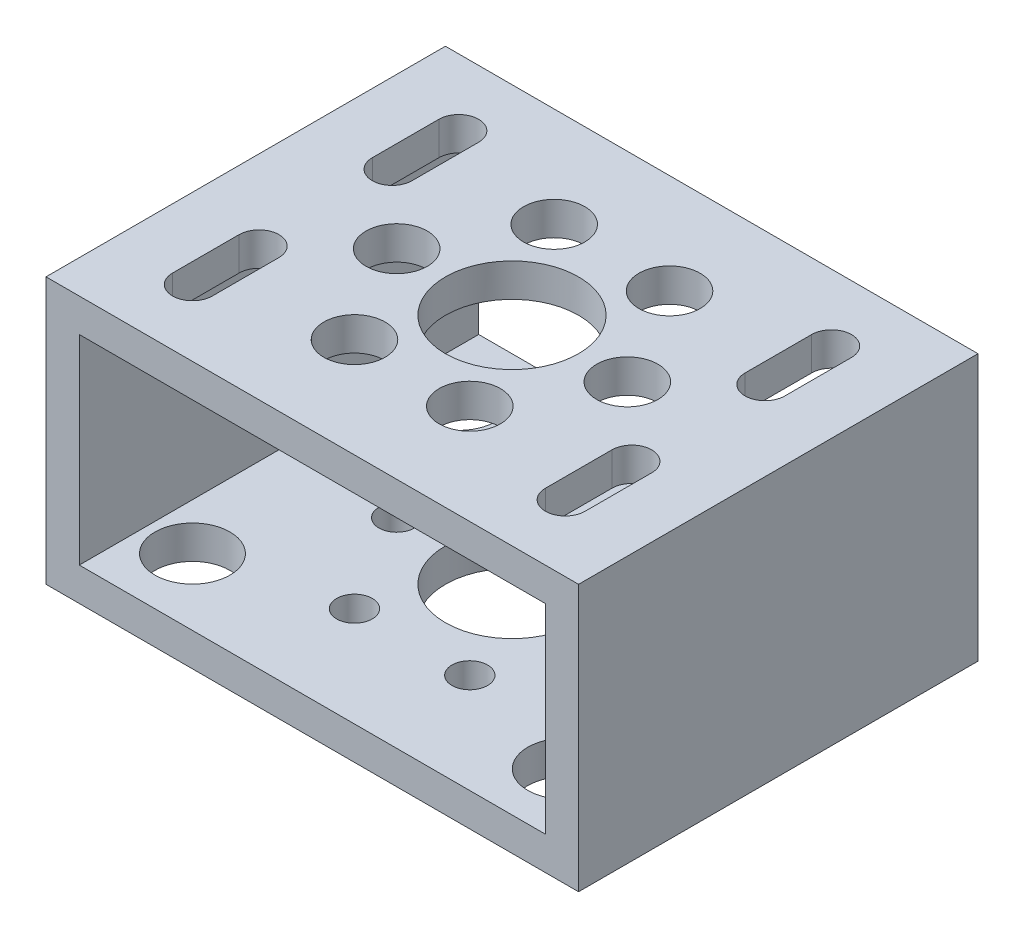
from build123d import *

# Parameters (mm, degrees)
SKETCH1_W                                      = 50.8
SKETCH1_H                                      = 25.4
SKETCH1_W_2                                    = 44.45
SKETCH1_H_2                                    = 19.05
EXTRUDE1_DEPTH                                 = 38.1
SKETCH2_R                                      = 6.35
CENTER_HOLE_DEPTH                              = 53.363441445
C_BORE_REACH                                   = 54.363
SKETCH6_R                                      = 2.921
CIRPATTERN1_COUNT                              = 6
CBORE_FOR_6_SOCKET_HEAD_CAP_SCREW1_D           = 3.7973
CBORE_FOR_6_SOCKET_HEAD_CAP_SCREW1_CBORE_D     = 7.14502
CBORE_FOR_6_SOCKET_HEAD_CAP_SCREW1_CBORE_DEPTH = 3.5052
SLOTS_REACH                                    = 54.363


with BuildPart() as part:
    # Sketch1 → Extrude1 (new body)
    with BuildSketch(Plane.XY):
        Rectangle(SKETCH1_W, SKETCH1_H)
        Rectangle(SKETCH1_W_2, SKETCH1_H_2, mode=Mode.SUBTRACT)
    extrude(amount=EXTRUDE1_DEPTH)

    # Sketch2 → center-hole (cut, through all)
    with BuildSketch(Plane(origin=(0, 12.7, 0), x_dir=(-1, 0, 0), z_dir=(0, 1, 0))):
        with Locations(Location((0, 19.05, 0), (0, 0, 90))):
            Circle(SKETCH2_R)
    extrude(amount=-CENTER_HOLE_DEPTH, mode=Mode.SUBTRACT)

    # Sketch3 → M3 Clearance Hole1 (revolve, cut)
    with BuildSketch(Plane(origin=(-11, 12.7, 19.05), x_dir=(0, 0, 1), z_dir=(1, 0, 0))):
        Polygon((0, 0), (0, 79.761463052), (1.7, 78.74), (1.7, 0), align=None)
    m3_clearance_hole1 = revolve(axis=Axis((-11, 19.05, 19.05), (0, -1, 0)), mode=Mode.SUBTRACT)

    # Sketch6 → c_bore (cut, up to next)
    with BuildSketch(Plane(origin=(0, 12.7, 0), x_dir=(-1, 0, 0), z_dir=(0, 1, 0)), mode=Mode.PRIVATE) as c_bore_sk1:
        with Locations(Location((11, 19.05, 0), (0, 0, 90))):
            Circle(SKETCH6_R)
    c_bore_tool1 = extrude(c_bore_sk1.sketch, amount=-C_BORE_REACH, mode=Mode.PRIVATE) & part.part
    c_bore = c_bore_tool1.solids().sort_by_distance((-11, 12.7, 19.05))[0]
    add(c_bore, mode=Mode.SUBTRACT)

    # CirPattern1: M3 Clearance Hole1, c_bore ×6 about axis
    cirpattern1_axis = Axis((0, 0, 19.05), (0, 1, 0))
    add([m3_clearance_hole1.rotate(cirpattern1_axis, i * 360 / CIRPATTERN1_COUNT) for i in range(1, CIRPATTERN1_COUNT)], mode=Mode.SUBTRACT)
    add([c_bore.rotate(cirpattern1_axis, i * 360 / CIRPATTERN1_COUNT) for i in range(1, CIRPATTERN1_COUNT)], mode=Mode.SUBTRACT)

    # CBORE for _6 Socket Head Cap Screw1 (through all)
    with Locations(Plane.XZ.offset(12.7)):
        with Locations((-17.78, 6.35), (17.78, 6.35), (-17.78, 31.75), (17.78, 31.75)):
            CounterBoreHole(CBORE_FOR_6_SOCKET_HEAD_CAP_SCREW1_D / 2, CBORE_FOR_6_SOCKET_HEAD_CAP_SCREW1_CBORE_D / 2, CBORE_FOR_6_SOCKET_HEAD_CAP_SCREW1_CBORE_DEPTH)

    # Sketch9 → SLOTs (cut, up to next)
    with BuildSketch(Plane(origin=(0, 12.7, 0), x_dir=(-1, 0, 0), z_dir=(0, 1, 0)), mode=Mode.PRIVATE) as slots_sk1:
        with BuildLine():
            Line((19.67865, 6.35), (19.67865, 12.7))
            ThreePointArc((19.67865, 12.7), (17.78, 14.59865), (15.88135, 12.7))
            Line((15.88135, 12.7), (15.88135, 6.35))
            ThreePointArc((15.88135, 6.35), (17.78, 4.45135), (19.67865, 6.35))
        make_face()
    slots_tool1 = extrude(slots_sk1.sketch, amount=-SLOTS_REACH, mode=Mode.PRIVATE) & part.part
    # Sketch9 → SLOTs (cut, up to next)
    with BuildSketch(Plane(origin=(0, 12.7, 0), x_dir=(-1, 0, 0), z_dir=(0, 1, 0)), mode=Mode.PRIVATE) as slots_sk2:
        with BuildLine():
            Line((15.88135, 25.4), (15.88135, 31.75))
            ThreePointArc((15.88135, 31.75), (17.78, 33.64865), (19.67865, 31.75))
            Line((19.67865, 31.75), (19.67865, 25.4))
            ThreePointArc((19.67865, 25.4), (17.78, 23.50135), (15.88135, 25.4))
        make_face()
    slots_tool2 = extrude(slots_sk2.sketch, amount=-SLOTS_REACH, mode=Mode.PRIVATE) & part.part
    # Sketch9 → SLOTs (cut, up to next)
    with BuildSketch(Plane(origin=(0, 12.7, 0), x_dir=(-1, 0, 0), z_dir=(0, 1, 0)), mode=Mode.PRIVATE) as slots_sk3:
        with BuildLine():
            Line((-19.67865, 31.75), (-19.67865, 25.4))
            ThreePointArc((-19.67865, 25.4), (-17.78, 23.50135), (-15.88135, 25.4))
            Line((-15.88135, 25.4), (-15.88135, 31.75))
            ThreePointArc((-15.88135, 31.75), (-17.78, 33.64865), (-19.67865, 31.75))
        make_face()
    slots_tool3 = extrude(slots_sk3.sketch, amount=-SLOTS_REACH, mode=Mode.PRIVATE) & part.part
    # Sketch9 → SLOTs (cut, up to next)
    with BuildSketch(Plane(origin=(0, 12.7, 0), x_dir=(-1, 0, 0), z_dir=(0, 1, 0)), mode=Mode.PRIVATE) as slots_sk4:
        with BuildLine():
            Line((-15.88135, 12.7), (-15.88135, 6.35))
            ThreePointArc((-15.88135, 6.35), (-17.78, 4.45135), (-19.67865, 6.35))
            Line((-19.67865, 6.35), (-19.67865, 12.7))
            ThreePointArc((-19.67865, 12.7), (-17.78, 14.59865), (-15.88135, 12.7))
        make_face()
    slots_tool4 = extrude(slots_sk4.sketch, amount=-SLOTS_REACH, mode=Mode.PRIVATE) & part.part
    add(slots_tool1.solids().sort_by_distance((-17.78, 12.7, 9.525))[0], mode=Mode.SUBTRACT)
    add(slots_tool2.solids().sort_by_distance((-17.78, 12.7, 28.575))[0], mode=Mode.SUBTRACT)
    add(slots_tool3.solids().sort_by_distance((17.78, 12.7, 28.575))[0], mode=Mode.SUBTRACT)
    add(slots_tool4.solids().sort_by_distance((17.78, 12.7, 9.525))[0], mode=Mode.SUBTRACT)


solid = part.part
